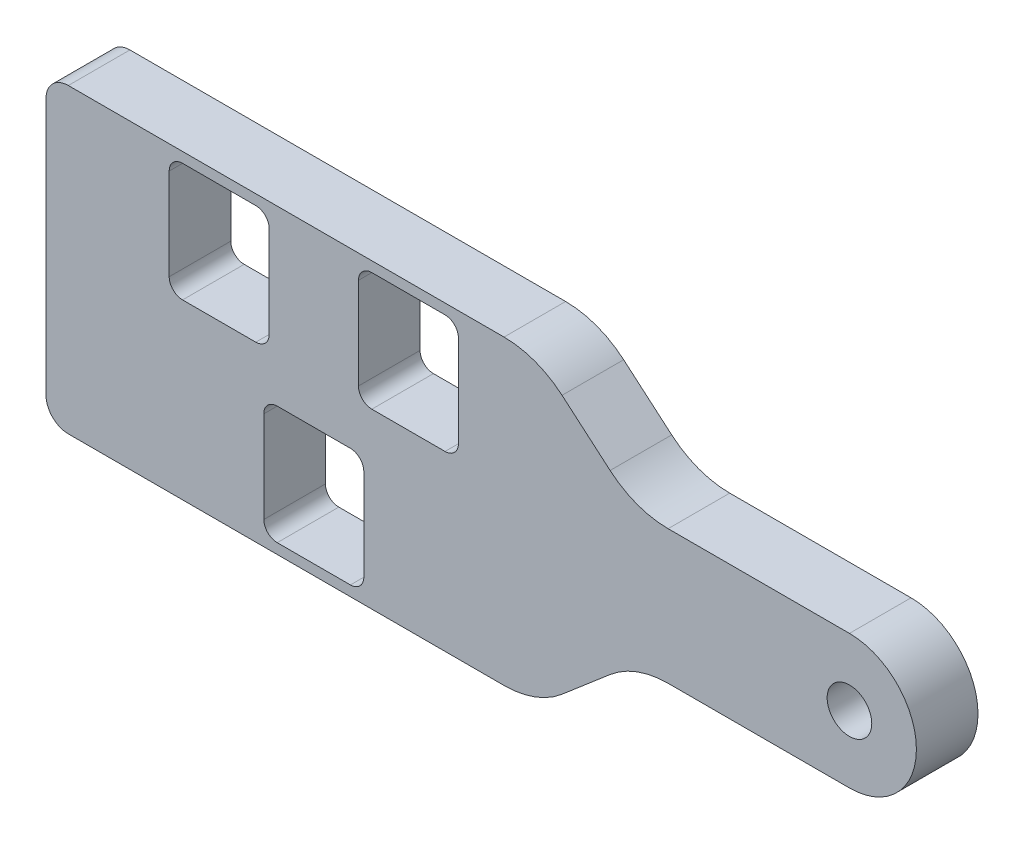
from build123d import *

# Parameters (mm, degrees)
SKETCH1_R           = 3.175
BOSS_EXTRUDE1_DEPTH = 8.763
CUT_EXTRUDE1_DEPTH  = 132.347106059


with BuildPart() as part:
    # Sketch1 → Boss-Extrude1 (new body)
    with BuildSketch(Plane.XY):
        with BuildLine():
            Line((114.3, 30.988), (88.502778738, 30.988))
            ThreePointArc((88.502778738, 30.988), (84.104236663, 31.774023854), (80.250160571, 34.034798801))
            Line((80.250160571, 34.034798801), (73.413882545, 39.879201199))
            ThreePointArc((73.413882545, 39.879201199), (69.559806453, 42.139976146), (65.161264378, 42.926))
            Line((65.161264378, 42.926), (3.175, 42.926))
            ThreePointArc((3.175, 42.926), (0.92993597, 41.99606403), (0, 39.751))
            Line((0, 39.751), (0, 3.175))
            ThreePointArc((0, 3.175), (0.92993597, 0.92993597), (3.175, 0))
            Line((3.175, 0), (65.161264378, 0))
            ThreePointArc((65.161264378, 0), (69.559806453, 0.786023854), (73.413882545, 3.046798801))
            Line((73.413882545, 3.046798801), (80.250160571, 8.891201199))
            ThreePointArc((80.250160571, 8.891201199), (84.104236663, 11.151976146), (88.502778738, 11.938))
            Line((88.502778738, 11.938), (114.3, 11.938))
            ThreePointArc((114.3, 11.938), (123.825, 21.463), (114.3, 30.988))
        make_face()
        with Locations((114.3, 21.463)):
            Circle(SKETCH1_R, mode=Mode.SUBTRACT)
    extrude(amount=BOSS_EXTRUDE1_DEPTH)

    # Sketch2 → Cut-Extrude1 (cut, through all)
    with BuildSketch(Plane.XY.offset(8.763)):
        with BuildLine():
            Line((32.893, 18.288), (43.307, 18.288))
            ThreePointArc((43.307, 18.288), (44.654038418, 17.730038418), (45.212, 16.383))
            Line((45.212, 16.383), (45.212, 3.3655))
            ThreePointArc((45.212, 3.3655), (44.654038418, 2.018461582), (43.307, 1.4605))
            Line((43.307, 1.4605), (32.893, 1.4605))
            ThreePointArc((32.893, 1.4605), (31.545961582, 2.018461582), (30.988, 3.3655))
            Line((30.988, 3.3655), (30.988, 16.383))
            ThreePointArc((30.988, 16.383), (31.545961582, 17.730038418), (32.893, 18.288))
        make_face()
        with BuildLine():
            Line((29.845, 41.4655), (19.431, 41.4655))
            ThreePointArc((19.431, 41.4655), (18.083961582, 40.907538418), (17.526, 39.5605))
            Line((17.526, 39.5605), (17.526, 26.543))
            ThreePointArc((17.526, 26.543), (18.083961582, 25.195961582), (19.431, 24.638))
            Line((19.431, 24.638), (29.845, 24.638))
            ThreePointArc((29.845, 24.638), (31.192038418, 25.195961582), (31.75, 26.543))
            Line((31.75, 26.543), (31.75, 39.5605))
            ThreePointArc((31.75, 39.5605), (31.192038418, 40.907538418), (29.845, 41.4655))
        make_face()
        with BuildLine():
            Line((58.674, 39.5605), (58.674, 26.543))
            ThreePointArc((58.674, 26.543), (58.116038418, 25.195961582), (56.769, 24.638))
            Line((56.769, 24.638), (46.355, 24.638))
            ThreePointArc((46.355, 24.638), (45.007961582, 25.195961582), (44.45, 26.543))
            Line((44.45, 26.543), (44.45, 39.5605))
            ThreePointArc((44.45, 39.5605), (45.007961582, 40.907538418), (46.355, 41.4655))
            Line((46.355, 41.4655), (56.769, 41.4655))
            ThreePointArc((56.769, 41.4655), (58.116038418, 40.907538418), (58.674, 39.5605))
        make_face()
    extrude(amount=-CUT_EXTRUDE1_DEPTH, mode=Mode.SUBTRACT)


solid = part.part
